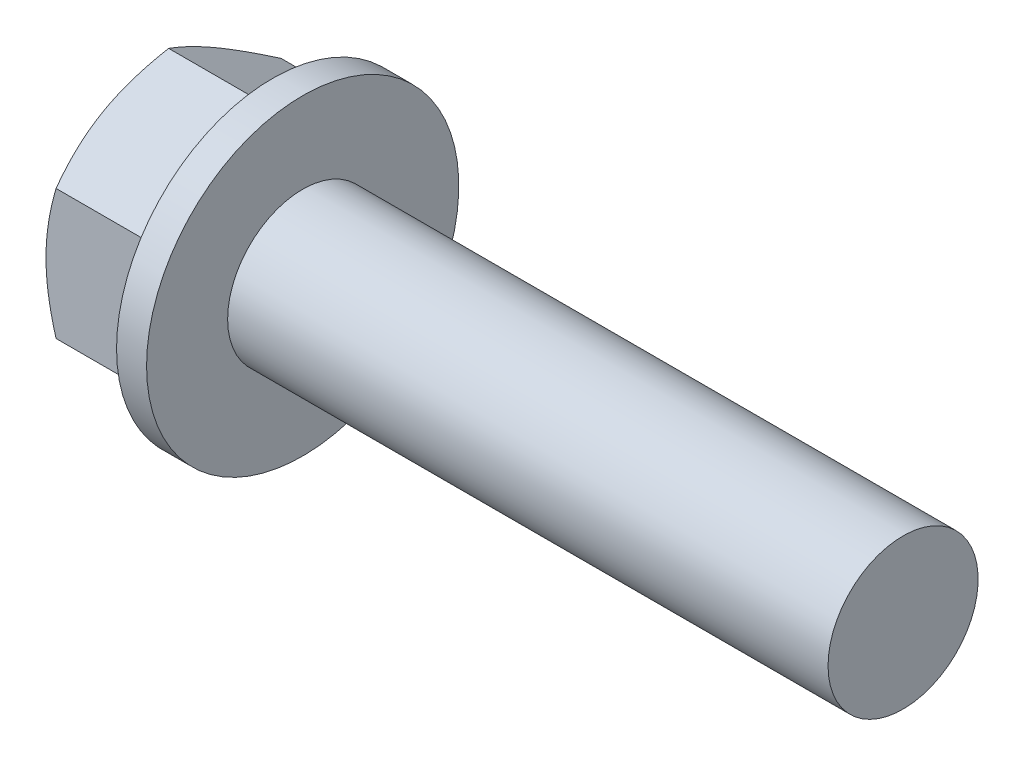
ISO-10303-21;
HEADER;
FILE_DESCRIPTION(('STEP AP214'),'2;1');
FILE_NAME('part.step','',(''),(''),'','','');
FILE_SCHEMA(('AUTOMOTIVE_DESIGN { 1 0 10303 214 1 1 1 1 }'));
ENDSEC;
DATA;
#1=APPLICATION_CONTEXT('core data for automotive mechanical design processes');
#2=APPLICATION_PROTOCOL_DEFINITION('international standard','automotive_design',2000,#1);
#3=PRODUCT_CONTEXT('',#1,'mechanical');
#4=PRODUCT('Part','Part','',(#3));
#5=PRODUCT_RELATED_PRODUCT_CATEGORY('part','',(#4));
#6=PRODUCT_DEFINITION_FORMATION('','',#4);
#7=PRODUCT_DEFINITION_CONTEXT('part definition',#1,'design');
#8=PRODUCT_DEFINITION('design','',#6,#7);
#9=PRODUCT_DEFINITION_SHAPE('','',#8);
#10=(LENGTH_UNIT() NAMED_UNIT(*) SI_UNIT(.MILLI.,.METRE.));
#11=(NAMED_UNIT(*) PLANE_ANGLE_UNIT() SI_UNIT($,.RADIAN.));
#12=(NAMED_UNIT(*) SI_UNIT($,.STERADIAN.) SOLID_ANGLE_UNIT());
#13=UNCERTAINTY_MEASURE_WITH_UNIT(LENGTH_MEASURE(1.E-05),#10,'distance_accuracy_value','');
#14=(GEOMETRIC_REPRESENTATION_CONTEXT(3) GLOBAL_UNCERTAINTY_ASSIGNED_CONTEXT((#13)) GLOBAL_UNIT_ASSIGNED_CONTEXT((#10,
#11,#12)) REPRESENTATION_CONTEXT('',''));
#15=CARTESIAN_POINT('',(0.,0.,0.));
#16=DIRECTION('',(0.,0.,1.));
#17=DIRECTION('',(1.,0.,0.));
#18=AXIS2_PLACEMENT_3D('',#15,#16,#17);
#19=CARTESIAN_POINT('',(0.,0.,0.));
#20=DIRECTION('',(-1.,0.,0.));
#21=DIRECTION('',(0.,0.,1.));
#22=AXIS2_PLACEMENT_3D('',#19,#20,#21);
#23=PLANE('',#22);
#24=CARTESIAN_POINT('',(0.,0.,0.));
#25=DIRECTION('',(-1.,0.,0.));
#26=DIRECTION('',(0.,0.,1.));
#27=AXIS2_PLACEMENT_3D('',#24,#25,#26);
#28=CIRCLE('',#27,4.7625);
#29=CARTESIAN_POINT('',(0.,0.,4.76250000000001));
#30=VERTEX_POINT('',#29);
#31=CARTESIAN_POINT('',(0.,4.12444599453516,2.38125001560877));
#32=VERTEX_POINT('',#31);
#33=EDGE_CURVE('E169',#30,#32,#28,.T.);
#34=ORIENTED_EDGE('',*,*,#33,.T.);
#35=CARTESIAN_POINT('',(0.,4.12444599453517,-2.38125001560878));
#36=VERTEX_POINT('',#35);
#37=EDGE_CURVE('E173',#32,#36,#28,.T.);
#38=ORIENTED_EDGE('',*,*,#37,.T.);
#39=CARTESIAN_POINT('',(0.,0.,-4.76249999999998));
#40=VERTEX_POINT('',#39);
#41=EDGE_CURVE('E422',#36,#40,#28,.T.);
#42=ORIENTED_EDGE('',*,*,#41,.T.);
#43=CARTESIAN_POINT('',(0.,-4.12444599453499,-2.38125001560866));
#44=VERTEX_POINT('',#43);
#45=EDGE_CURVE('E421',#40,#44,#28,.T.);
#46=ORIENTED_EDGE('',*,*,#45,.T.);
#47=CARTESIAN_POINT('',(0.,-4.12444599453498,2.38125001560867));
#48=VERTEX_POINT('',#47);
#49=EDGE_CURVE('E419',#44,#48,#28,.T.);
#50=ORIENTED_EDGE('',*,*,#49,.T.);
#51=EDGE_CURVE('E168',#48,#30,#28,.T.);
#52=ORIENTED_EDGE('',*,*,#51,.T.);
#53=EDGE_LOOP('',(#34,#38,#42,#46,#50,#52));
#54=FACE_BOUND('',#53,.T.);
#55=CARTESIAN_POINT('',(0.,0.,0.));
#56=DIRECTION('',(1.,0.,0.));
#57=DIRECTION('',(0.,0.,-1.));
#58=AXIS2_PLACEMENT_3D('',#55,#56,#57);
#59=CIRCLE('',#58,4.1671875);
#60=CARTESIAN_POINT('',(0.,0.,4.1671875));
#61=VERTEX_POINT('',#60);
#62=EDGE_CURVE('E136',#61,#61,#59,.T.);
#63=ORIENTED_EDGE('',*,*,#62,.T.);
#64=EDGE_LOOP('',(#63));
#65=FACE_BOUND('',#64,.T.);
#66=ADVANCED_FACE('F36',(#54,#65),#23,.T.);
#67=CARTESIAN_POINT('',(-25.4,0.,0.));
#68=DIRECTION('',(-1.,0.,0.));
#69=DIRECTION('',(0.,0.,1.));
#70=AXIS2_PLACEMENT_3D('',#67,#68,#69);
#71=CYLINDRICAL_SURFACE('',#70,3.175);
#72=CARTESIAN_POINT('',(31.496,0.,0.));
#73=DIRECTION('',(-1.,0.,0.));
#74=DIRECTION('',(0.,0.,1.));
#75=AXIS2_PLACEMENT_3D('',#72,#73,#74);
#76=CIRCLE('',#75,3.175);
#77=CARTESIAN_POINT('',(31.496,0.,3.17500000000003));
#78=VERTEX_POINT('',#77);
#79=EDGE_CURVE('E172',#78,#78,#76,.T.);
#80=CARTESIAN_POINT('',(6.09599999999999,0.,0.));
#81=DIRECTION('',(-1.,0.,0.));
#82=DIRECTION('',(0.,0.,1.));
#83=AXIS2_PLACEMENT_3D('',#80,#81,#82);
#84=CIRCLE('',#83,3.175);
#85=CARTESIAN_POINT('',(6.09599999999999,0.,3.17500000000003));
#86=VERTEX_POINT('',#85);
#87=EDGE_CURVE('E149',#86,#86,#84,.T.);
#88=CARTESIAN_POINT('',(31.496,0.,3.17500000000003));
#89=CARTESIAN_POINT('',(31.2314166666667,0.,3.17500000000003));
#90=CARTESIAN_POINT('',(30.9668333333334,0.,3.17500000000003));
#91=CARTESIAN_POINT('',(30.4376666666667,0.,3.17500000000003));
#92=CARTESIAN_POINT('',(30.1730833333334,0.,3.17500000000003));
#93=CARTESIAN_POINT('',(29.6439166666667,0.,3.17500000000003));
#94=CARTESIAN_POINT('',(29.3793333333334,0.,3.17500000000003));
#95=CARTESIAN_POINT('',(28.8501666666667,0.,3.17500000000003));
#96=CARTESIAN_POINT('',(28.5855833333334,0.,3.17500000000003));
#97=CARTESIAN_POINT('',(28.0564166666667,0.,3.17500000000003));
#98=CARTESIAN_POINT('',(27.7918333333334,0.,3.17500000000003));
#99=CARTESIAN_POINT('',(27.2626666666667,0.,3.17500000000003));
#100=CARTESIAN_POINT('',(26.9980833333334,0.,3.17500000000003));
#101=CARTESIAN_POINT('',(26.4689166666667,0.,3.17500000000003));
#102=CARTESIAN_POINT('',(26.2043333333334,0.,3.17500000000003));
#103=CARTESIAN_POINT('',(25.6751666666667,0.,3.17500000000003));
#104=CARTESIAN_POINT('',(25.4105833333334,0.,3.17500000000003));
#105=CARTESIAN_POINT('',(24.8814166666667,0.,3.17500000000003));
#106=CARTESIAN_POINT('',(24.6168333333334,0.,3.17500000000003));
#107=CARTESIAN_POINT('',(24.0876666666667,0.,3.17500000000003));
#108=CARTESIAN_POINT('',(23.8230833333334,0.,3.17500000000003));
#109=CARTESIAN_POINT('',(23.2939166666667,0.,3.17500000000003));
#110=CARTESIAN_POINT('',(23.0293333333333,0.,3.17500000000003));
#111=CARTESIAN_POINT('',(22.5001666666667,0.,3.17500000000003));
#112=CARTESIAN_POINT('',(22.2355833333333,0.,3.17500000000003));
#113=CARTESIAN_POINT('',(21.7064166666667,0.,3.17500000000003));
#114=CARTESIAN_POINT('',(21.4418333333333,0.,3.17500000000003));
#115=CARTESIAN_POINT('',(20.9126666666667,0.,3.17500000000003));
#116=CARTESIAN_POINT('',(20.6480833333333,0.,3.17500000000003));
#117=CARTESIAN_POINT('',(20.1189166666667,0.,3.17500000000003));
#118=CARTESIAN_POINT('',(19.8543333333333,0.,3.17500000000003));
#119=CARTESIAN_POINT('',(19.3251666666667,0.,3.17500000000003));
#120=CARTESIAN_POINT('',(19.0605833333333,0.,3.17500000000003));
#121=CARTESIAN_POINT('',(18.5314166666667,0.,3.17500000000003));
#122=CARTESIAN_POINT('',(18.2668333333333,0.,3.17500000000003));
#123=CARTESIAN_POINT('',(17.7376666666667,0.,3.17500000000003));
#124=CARTESIAN_POINT('',(17.4730833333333,0.,3.17500000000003));
#125=CARTESIAN_POINT('',(16.9439166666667,0.,3.17500000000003));
#126=CARTESIAN_POINT('',(16.6793333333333,0.,3.17500000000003));
#127=CARTESIAN_POINT('',(16.1501666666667,0.,3.17500000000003));
#128=CARTESIAN_POINT('',(15.8855833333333,0.,3.17500000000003));
#129=CARTESIAN_POINT('',(15.3564166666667,0.,3.17500000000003));
#130=CARTESIAN_POINT('',(15.0918333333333,0.,3.17500000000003));
#131=CARTESIAN_POINT('',(14.5626666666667,0.,3.17500000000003));
#132=CARTESIAN_POINT('',(14.2980833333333,0.,3.17500000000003));
#133=CARTESIAN_POINT('',(13.7689166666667,0.,3.17500000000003));
#134=CARTESIAN_POINT('',(13.5043333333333,0.,3.17500000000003));
#135=CARTESIAN_POINT('',(12.9751666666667,0.,3.17500000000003));
#136=CARTESIAN_POINT('',(12.7105833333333,0.,3.17500000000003));
#137=CARTESIAN_POINT('',(12.1814166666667,0.,3.17500000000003));
#138=CARTESIAN_POINT('',(11.9168333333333,0.,3.17500000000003));
#139=CARTESIAN_POINT('',(11.3876666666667,0.,3.17500000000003));
#140=CARTESIAN_POINT('',(11.1230833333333,0.,3.17500000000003));
#141=CARTESIAN_POINT('',(10.5939166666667,0.,3.17500000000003));
#142=CARTESIAN_POINT('',(10.3293333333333,0.,3.17500000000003));
#143=CARTESIAN_POINT('',(9.80016666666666,0.,3.17500000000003));
#144=CARTESIAN_POINT('',(9.53558333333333,0.,3.17500000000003));
#145=CARTESIAN_POINT('',(9.00641666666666,0.,3.17500000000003));
#146=CARTESIAN_POINT('',(8.74183333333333,0.,3.17500000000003));
#147=CARTESIAN_POINT('',(8.21266666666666,0.,3.17500000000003));
#148=CARTESIAN_POINT('',(7.94808333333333,0.,3.17500000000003));
#149=CARTESIAN_POINT('',(7.41891666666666,0.,3.17500000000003));
#150=CARTESIAN_POINT('',(7.15433333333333,0.,3.17500000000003));
#151=CARTESIAN_POINT('',(6.62516666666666,0.,3.17500000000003));
#152=CARTESIAN_POINT('',(6.36058333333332,0.,3.17500000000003));
#153=CARTESIAN_POINT('',(6.09599999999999,0.,3.17500000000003));
#154=B_SPLINE_CURVE_WITH_KNOTS('',3,(#88,#89,#90,#91,#92,#93,#94,#95,#96,#97,#98,#99,#100,#101,
#102,#103,#104,#105,#106,#107,#108,#109,#110,#111,#112,#113,#114,#115,#116,#117,#118,#119,#120,
#121,#122,#123,#124,#125,#126,#127,#128,#129,#130,#131,#132,#133,#134,#135,#136,#137,#138,#139,
#140,#141,#142,#143,#144,#145,#146,#147,#148,#149,#150,#151,#152,#153),.UNSPECIFIED.,.F.,.F.,(4,
2,2,2,2,2,2,2,2,2,2,2,2,2,2,2,2,2,2,2,2,2,2,2,2,2,2,2,2,2,2,2,4),(0.,0.793750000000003,
1.58750000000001,2.38124999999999,3.175,3.96875,4.7625,5.55625000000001,6.35,7.14375,
7.93750000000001,8.73125000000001,9.52500000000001,10.31875,11.1125,11.90625,12.7,13.49375,
14.2875,15.08125,15.875,16.66875,17.4625,18.25625,19.05,19.84375,20.6375,21.43125,22.225,
23.01875,23.8125,24.60625,25.4),.UNSPECIFIED.);
#155=EDGE_CURVE('BSEAM38',#78,#86,#154,.T.);
#156=ORIENTED_EDGE('',*,*,#79,.T.);
#157=ORIENTED_EDGE('',*,*,#87,.F.);
#158=ORIENTED_EDGE('',*,*,#155,.T.);
#159=ORIENTED_EDGE('',*,*,#155,.F.);
#160=EDGE_LOOP('',(#156,#158,#157,#159));
#161=FACE_BOUND('',#160,.T.);
#162=ADVANCED_FACE('F38',(#161),#71,.T.);
#163=CARTESIAN_POINT('',(31.4960000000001,3.175,0.));
#164=DIRECTION('',(1.,0.,0.));
#165=DIRECTION('',(0.,0.,-1.));
#166=AXIS2_PLACEMENT_3D('',#163,#164,#165);
#167=PLANE('',#166);
#168=ORIENTED_EDGE('',*,*,#79,.F.);
#169=EDGE_LOOP('',(#168));
#170=FACE_BOUND('',#169,.T.);
#171=ADVANCED_FACE('F252',(#170),#167,.T.);
#172=CARTESIAN_POINT('',(4.826,5.49942263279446,0.));
#173=DIRECTION('',(-1.,0.,0.));
#174=DIRECTION('',(0.,0.,1.));
#175=AXIS2_PLACEMENT_3D('',#172,#173,#174);
#176=PLANE('',#175);
#177=CARTESIAN_POINT('',(4.82600000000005,0.,0.));
#178=DIRECTION('',(-1.,0.,0.));
#179=DIRECTION('',(0.,0.,1.));
#180=AXIS2_PLACEMENT_3D('',#177,#178,#179);
#181=CIRCLE('',#180,6.604);
#182=CARTESIAN_POINT('',(4.82600000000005,0.,6.60400000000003));
#183=VERTEX_POINT('',#182);
#184=EDGE_CURVE('E165',#183,#183,#181,.T.);
#185=ORIENTED_EDGE('',*,*,#184,.T.);
#186=EDGE_LOOP('',(#185));
#187=FACE_BOUND('',#186,.T.);
#188=DIRECTION('',(0.,1.,0.));
#189=VECTOR('',#188,1.);
#190=CARTESIAN_POINT('',(4.82600000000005,-2.74963066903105,4.76250000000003));
#191=LINE('',#190,#189);
#192=CARTESIAN_POINT('',(4.82600000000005,-2.74963066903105,4.76250000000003));
#193=VERTEX_POINT('',#192);
#194=CARTESIAN_POINT('',(4.826,2.74963066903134,4.76250000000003));
#195=VERTEX_POINT('',#194);
#196=EDGE_CURVE('E124',#193,#195,#191,.T.);
#197=ORIENTED_EDGE('',*,*,#196,.F.);
#198=DIRECTION('',(0.,0.50000000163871,0.866025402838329));
#199=VECTOR('',#198,1.);
#200=CARTESIAN_POINT('',(4.82600000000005,-5.49926133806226,0.));
#201=LINE('',#200,#199);
#202=CARTESIAN_POINT('',(4.82600000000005,-5.49926133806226,0.));
#203=VERTEX_POINT('',#202);
#204=EDGE_CURVE('E118',#203,#193,#201,.T.);
#205=ORIENTED_EDGE('',*,*,#204,.F.);
#206=DIRECTION('',(0.,-0.50000000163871,0.866025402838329));
#207=VECTOR('',#206,1.);
#208=CARTESIAN_POINT('',(4.82600000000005,-2.74963066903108,-4.76249999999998));
#209=LINE('',#208,#207);
#210=CARTESIAN_POINT('',(4.82600000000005,-2.74963066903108,-4.76249999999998));
#211=VERTEX_POINT('',#210);
#212=EDGE_CURVE('E144',#211,#203,#209,.T.);
#213=ORIENTED_EDGE('',*,*,#212,.F.);
#214=DIRECTION('',(0.,-1.,0.));
#215=VECTOR('',#214,1.);
#216=CARTESIAN_POINT('',(4.82600000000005,2.74963066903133,-4.76249999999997));
#217=LINE('',#216,#215);
#218=CARTESIAN_POINT('',(4.82600000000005,2.74963066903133,-4.76249999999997));
#219=VERTEX_POINT('',#218);
#220=EDGE_CURVE('E141',#219,#211,#217,.T.);
#221=ORIENTED_EDGE('',*,*,#220,.F.);
#222=DIRECTION('',(0.,-0.50000000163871,-0.866025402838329));
#223=VECTOR('',#222,1.);
#224=CARTESIAN_POINT('',(4.826,5.4992613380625,0.));
#225=LINE('',#224,#223);
#226=CARTESIAN_POINT('',(4.826,5.4992613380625,0.));
#227=VERTEX_POINT('',#226);
#228=EDGE_CURVE('E128',#227,#219,#225,.T.);
#229=ORIENTED_EDGE('',*,*,#228,.F.);
#230=DIRECTION('',(0.,0.50000000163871,-0.866025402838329));
#231=VECTOR('',#230,1.);
#232=CARTESIAN_POINT('',(4.826,2.74963066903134,4.76250000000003));
#233=LINE('',#232,#231);
#234=EDGE_CURVE('E114',#195,#227,#233,.T.);
#235=ORIENTED_EDGE('',*,*,#234,.F.);
#236=EDGE_LOOP('',(#197,#205,#213,#221,#229,#235));
#237=FACE_BOUND('',#236,.T.);
#238=ADVANCED_FACE('F122',(#187,#237),#176,.T.);
#239=CARTESIAN_POINT('',(-25.4,0.,0.));
#240=DIRECTION('',(-1.,0.,0.));
#241=DIRECTION('',(0.,0.,1.));
#242=AXIS2_PLACEMENT_3D('',#239,#240,#241);
#243=CYLINDRICAL_SURFACE('',#242,6.604);
#244=CARTESIAN_POINT('',(6.09599999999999,0.,0.));
#245=DIRECTION('',(-1.,0.,0.));
#246=DIRECTION('',(0.,0.,1.));
#247=AXIS2_PLACEMENT_3D('',#244,#245,#246);
#248=CIRCLE('',#247,6.604);
#249=CARTESIAN_POINT('',(6.09599999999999,0.,6.60400000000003));
#250=VERTEX_POINT('',#249);
#251=EDGE_CURVE('E162',#250,#250,#248,.T.);
#252=CARTESIAN_POINT('',(6.09599999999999,0.,6.60400000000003));
#253=CARTESIAN_POINT('',(6.08277083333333,0.,6.60400000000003));
#254=CARTESIAN_POINT('',(6.06954166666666,0.,6.60400000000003));
#255=CARTESIAN_POINT('',(6.04308333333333,0.,6.60400000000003));
#256=CARTESIAN_POINT('',(6.02985416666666,0.,6.60400000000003));
#257=CARTESIAN_POINT('',(6.00339583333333,0.,6.60400000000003));
#258=CARTESIAN_POINT('',(5.99016666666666,0.,6.60400000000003));
#259=CARTESIAN_POINT('',(5.96370833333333,0.,6.60400000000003));
#260=CARTESIAN_POINT('',(5.95047916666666,0.,6.60400000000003));
#261=CARTESIAN_POINT('',(5.92402083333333,0.,6.60400000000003));
#262=CARTESIAN_POINT('',(5.91079166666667,0.,6.60400000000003));
#263=CARTESIAN_POINT('',(5.88433333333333,0.,6.60400000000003));
#264=CARTESIAN_POINT('',(5.87110416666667,0.,6.60400000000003));
#265=CARTESIAN_POINT('',(5.84464583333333,0.,6.60400000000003));
#266=CARTESIAN_POINT('',(5.83141666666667,0.,6.60400000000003));
#267=CARTESIAN_POINT('',(5.80495833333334,0.,6.60400000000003));
#268=CARTESIAN_POINT('',(5.79172916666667,0.,6.60400000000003));
#269=CARTESIAN_POINT('',(5.76527083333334,0.,6.60400000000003));
#270=CARTESIAN_POINT('',(5.75204166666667,0.,6.60400000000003));
#271=CARTESIAN_POINT('',(5.72558333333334,0.,6.60400000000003));
#272=CARTESIAN_POINT('',(5.71235416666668,0.,6.60400000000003));
#273=CARTESIAN_POINT('',(5.68589583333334,0.,6.60400000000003));
#274=CARTESIAN_POINT('',(5.67266666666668,0.,6.60400000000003));
#275=CARTESIAN_POINT('',(5.64620833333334,0.,6.60400000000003));
#276=CARTESIAN_POINT('',(5.63297916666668,0.,6.60400000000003));
#277=CARTESIAN_POINT('',(5.60652083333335,0.,6.60400000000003));
#278=CARTESIAN_POINT('',(5.59329166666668,0.,6.60400000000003));
#279=CARTESIAN_POINT('',(5.56683333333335,0.,6.60400000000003));
#280=CARTESIAN_POINT('',(5.55360416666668,0.,6.60400000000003));
#281=CARTESIAN_POINT('',(5.52714583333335,0.,6.60400000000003));
#282=CARTESIAN_POINT('',(5.51391666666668,0.,6.60400000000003));
#283=CARTESIAN_POINT('',(5.48745833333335,0.,6.60400000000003));
#284=CARTESIAN_POINT('',(5.47422916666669,0.,6.60400000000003));
#285=CARTESIAN_POINT('',(5.44777083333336,0.,6.60400000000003));
#286=CARTESIAN_POINT('',(5.43454166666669,0.,6.60400000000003));
#287=CARTESIAN_POINT('',(5.40808333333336,0.,6.60400000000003));
#288=CARTESIAN_POINT('',(5.39485416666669,0.,6.60400000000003));
#289=CARTESIAN_POINT('',(5.36839583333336,0.,6.60400000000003));
#290=CARTESIAN_POINT('',(5.35516666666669,0.,6.60400000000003));
#291=CARTESIAN_POINT('',(5.32870833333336,0.,6.60400000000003));
#292=CARTESIAN_POINT('',(5.31547916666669,0.,6.60400000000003));
#293=CARTESIAN_POINT('',(5.28902083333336,0.,6.60400000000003));
#294=CARTESIAN_POINT('',(5.2757916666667,0.,6.60400000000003));
#295=CARTESIAN_POINT('',(5.24933333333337,0.,6.60400000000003));
#296=CARTESIAN_POINT('',(5.2361041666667,0.,6.60400000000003));
#297=CARTESIAN_POINT('',(5.20964583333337,0.,6.60400000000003));
#298=CARTESIAN_POINT('',(5.1964166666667,0.,6.60400000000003));
#299=CARTESIAN_POINT('',(5.16995833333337,0.,6.60400000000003));
#300=CARTESIAN_POINT('',(5.1567291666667,0.,6.60400000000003));
#301=CARTESIAN_POINT('',(5.13027083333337,0.,6.60400000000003));
#302=CARTESIAN_POINT('',(5.11704166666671,0.,6.60400000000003));
#303=CARTESIAN_POINT('',(5.09058333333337,0.,6.60400000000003));
#304=CARTESIAN_POINT('',(5.07735416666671,0.,6.60400000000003));
#305=CARTESIAN_POINT('',(5.05089583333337,0.,6.60400000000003));
#306=CARTESIAN_POINT('',(5.03766666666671,0.,6.60400000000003));
#307=CARTESIAN_POINT('',(5.01120833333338,0.,6.60400000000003));
#308=CARTESIAN_POINT('',(4.99797916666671,0.,6.60400000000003));
#309=CARTESIAN_POINT('',(4.97152083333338,0.,6.60400000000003));
#310=CARTESIAN_POINT('',(4.95829166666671,0.,6.60400000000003));
#311=CARTESIAN_POINT('',(4.93183333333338,0.,6.60400000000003));
#312=CARTESIAN_POINT('',(4.91860416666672,0.,6.60400000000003));
#313=CARTESIAN_POINT('',(4.89214583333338,0.,6.60400000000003));
#314=CARTESIAN_POINT('',(4.87891666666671,0.,6.60400000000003));
#315=CARTESIAN_POINT('',(4.85245833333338,0.,6.60400000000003));
#316=CARTESIAN_POINT('',(4.83922916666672,0.,6.60400000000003));
#317=CARTESIAN_POINT('',(4.82600000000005,0.,6.60400000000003));
#318=B_SPLINE_CURVE_WITH_KNOTS('',3,(#252,#253,#254,#255,#256,#257,#258,#259,#260,#261,#262,
#263,#264,#265,#266,#267,#268,#269,#270,#271,#272,#273,#274,#275,#276,#277,#278,#279,#280,#281,
#282,#283,#284,#285,#286,#287,#288,#289,#290,#291,#292,#293,#294,#295,#296,#297,#298,#299,#300,
#301,#302,#303,#304,#305,#306,#307,#308,#309,#310,#311,#312,#313,#314,#315,#316,#317),
.UNSPECIFIED.,.F.,.F.,(4,2,2,2,2,2,2,2,2,2,2,2,2,2,2,2,2,2,2,2,2,2,2,2,2,2,2,2,2,2,2,2,4),(0.,
0.0396874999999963,0.0793749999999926,0.119062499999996,0.158749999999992,0.198437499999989,
0.238124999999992,0.277812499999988,0.317499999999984,0.357187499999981,0.396874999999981,
0.43656249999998,0.476249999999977,0.515937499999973,0.555624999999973,0.595312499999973,
0.634999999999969,0.674687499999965,0.714374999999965,0.754062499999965,0.793749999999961,
0.833437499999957,0.873124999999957,0.912812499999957,0.952499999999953,0.99218749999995,
1.03187499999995,1.07156249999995,1.11124999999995,1.15093749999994,1.19062499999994,
1.23031249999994,1.26999999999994),.UNSPECIFIED.);
#319=EDGE_CURVE('BSEAM260',#250,#183,#318,.T.);
#320=ORIENTED_EDGE('',*,*,#251,.T.);
#321=ORIENTED_EDGE('',*,*,#184,.F.);
#322=ORIENTED_EDGE('',*,*,#319,.T.);
#323=ORIENTED_EDGE('',*,*,#319,.F.);
#324=EDGE_LOOP('',(#320,#322,#321,#323));
#325=FACE_BOUND('',#324,.T.);
#326=ADVANCED_FACE('F260',(#325),#243,.T.);
#327=CARTESIAN_POINT('',(6.09599999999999,3.175,0.));
#328=DIRECTION('',(-1.,0.,0.));
#329=DIRECTION('',(0.,0.,1.));
#330=AXIS2_PLACEMENT_3D('',#327,#328,#329);
#331=PLANE('',#330);
#332=ORIENTED_EDGE('',*,*,#251,.F.);
#333=EDGE_LOOP('',(#332));
#334=FACE_BOUND('',#333,.T.);
#335=ORIENTED_EDGE('',*,*,#87,.T.);
#336=EDGE_LOOP('',(#335));
#337=FACE_BOUND('',#336,.T.);
#338=ADVANCED_FACE('F204',(#334,#337),#331,.F.);
#339=CARTESIAN_POINT('',(4.82600000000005,-2.74963066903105,4.76250000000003));
#340=DIRECTION('',(0.,0.,1.));
#341=DIRECTION('',(0.,-1.,0.));
#342=AXIS2_PLACEMENT_3D('',#339,#340,#341);
#343=PLANE('',#342);
#344=DIRECTION('',(-1.,0.,0.));
#345=VECTOR('',#344,1.);
#346=CARTESIAN_POINT('',(4.82600000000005,-2.74963066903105,4.76250000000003));
#347=LINE('',#346,#345);
#348=CARTESIAN_POINT('',(0.425369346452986,-2.74963066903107,4.76249999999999));
#349=VERTEX_POINT('',#348);
#350=EDGE_CURVE('E132',#193,#349,#347,.T.);
#351=ORIENTED_EDGE('',*,*,#350,.F.);
#352=ORIENTED_EDGE('',*,*,#196,.T.);
#353=DIRECTION('',(-1.,0.,0.));
#354=VECTOR('',#353,1.);
#355=CARTESIAN_POINT('',(4.826,2.74963066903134,4.76250000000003));
#356=LINE('',#355,#354);
#357=CARTESIAN_POINT('',(0.425369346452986,2.74963066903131,4.76250000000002));
#358=VERTEX_POINT('',#357);
#359=EDGE_CURVE('E111',#195,#358,#356,.T.);
#360=ORIENTED_EDGE('',*,*,#359,.T.);
#361=CARTESIAN_POINT('',(2.27898968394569,-7.29243864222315,4.76250000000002));
#362=CARTESIAN_POINT('',(2.1779405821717,-7.08333786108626,4.76250000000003));
#363=CARTESIAN_POINT('',(2.07789598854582,-6.87374269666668,4.76250000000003));
#364=CARTESIAN_POINT('',(1.88038982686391,-6.45329629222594,4.76250000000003));
#365=CARTESIAN_POINT('',(1.782928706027,-6.24244484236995,4.76250000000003));
#366=CARTESIAN_POINT('',(1.59065007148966,-5.81807956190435,4.76250000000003));
#367=CARTESIAN_POINT('',(1.49585087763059,-5.60455740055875,4.76250000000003));
#368=CARTESIAN_POINT('',(1.31032432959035,-5.17575810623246,4.76250000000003));
#369=CARTESIAN_POINT('',(1.21959676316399,-4.96048106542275,4.76250000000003));
#370=CARTESIAN_POINT('',(1.04221901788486,-4.52515712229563,4.76250000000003));
#371=CARTESIAN_POINT('',(0.955632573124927,-4.30508410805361,4.76250000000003));
#372=CARTESIAN_POINT('',(0.789241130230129,-3.86234213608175,4.76250000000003));
#373=CARTESIAN_POINT('',(0.709436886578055,-3.63967289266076,4.76250000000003));
#374=CARTESIAN_POINT('',(0.558753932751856,-3.1918423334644,4.76250000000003));
#375=CARTESIAN_POINT('',(0.48785624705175,-2.96668746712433,4.76250000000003));
#376=CARTESIAN_POINT('',(0.357289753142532,-2.51317453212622,4.76250000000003));
#377=CARTESIAN_POINT('',(0.297617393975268,-2.28481750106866,4.76250000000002));
#378=CARTESIAN_POINT('',(0.192395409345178,-1.82475526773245,4.76250000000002));
#379=CARTESIAN_POINT('',(0.146849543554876,-1.59304919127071,4.76250000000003));
#380=CARTESIAN_POINT('',(0.0729585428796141,-1.126810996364,4.76250000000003));
#381=CARTESIAN_POINT('',(0.0446134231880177,-0.892278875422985,4.76250000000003));
#382=CARTESIAN_POINT('',(0.0168133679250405,-0.540107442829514,4.76250000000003));
#383=CARTESIAN_POINT('',(0.00999820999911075,-0.423019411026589,4.76250000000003));
#384=CARTESIAN_POINT('',(0.00132937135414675,-0.18865445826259,4.76250000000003));
#385=CARTESIAN_POINT('',(-0.000524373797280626,-0.0713775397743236,4.76250000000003));
#386=CARTESIAN_POINT('',(0.000779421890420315,0.163114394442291,4.76250000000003));
#387=CARTESIAN_POINT('',(0.00393554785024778,0.280329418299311,4.76250000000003));
#388=CARTESIAN_POINT('',(0.0151790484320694,0.51452469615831,4.76250000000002));
#389=CARTESIAN_POINT('',(0.0232666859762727,0.631504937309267,4.76250000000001));
#390=CARTESIAN_POINT('',(0.0486779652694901,0.915041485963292,4.7625));
#391=CARTESIAN_POINT('',(0.068473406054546,1.08138054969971,4.76250000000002));
#392=CARTESIAN_POINT('',(0.116932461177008,1.41275214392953,4.76250000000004));
#393=CARTESIAN_POINT('',(0.145597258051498,1.57778449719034,4.76250000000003));
#394=CARTESIAN_POINT('',(0.243380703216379,2.0708285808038,4.76250000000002));
#395=CARTESIAN_POINT('',(0.324262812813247,2.39653421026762,4.76250000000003));
#396=CARTESIAN_POINT('',(0.463764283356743,2.88389972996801,4.76250000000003));
#397=CARTESIAN_POINT('',(0.514005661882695,3.04810170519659,4.76250000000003));
#398=CARTESIAN_POINT('',(0.619459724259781,3.37479214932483,4.76250000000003));
#399=CARTESIAN_POINT('',(0.674668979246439,3.53728171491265,4.76250000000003));
#400=CARTESIAN_POINT('',(0.788910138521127,3.85986745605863,4.76250000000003));
#401=CARTESIAN_POINT('',(0.847918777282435,4.01997195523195,4.76250000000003));
#402=CARTESIAN_POINT('',(0.969399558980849,4.33893875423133,4.76250000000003));
#403=CARTESIAN_POINT('',(1.0318731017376,4.49780052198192,4.76250000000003));
#404=CARTESIAN_POINT('',(1.0957371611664,4.6560879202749,4.76250000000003));
#405=B_SPLINE_CURVE_WITH_KNOTS('',3,(#361,#362,#363,#364,#365,#366,#367,#368,#369,#370,#371,
#372,#373,#374,#375,#376,#377,#378,#379,#380,#381,#382,#383,#384,#385,#386,#387,#388,#389,#390,
#391,#392,#393,#394,#395,#396,#397,#398,#399,#400,#401,#402,#403,#404),.UNSPECIFIED.,.F.,.F.,(4,
2,2,2,2,2,2,2,2,2,2,2,2,2,2,2,2,2,2,2,2,4),(0.,0.69672057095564,1.39356097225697,2.094389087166,
2.7951806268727,3.50457590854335,4.21405000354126,4.92198595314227,5.62969758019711,
6.33759739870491,7.04549784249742,7.39726713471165,7.74903185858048,8.10069725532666,
8.45238140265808,8.95463428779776,9.45695416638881,10.4623537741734,10.9774624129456,
11.4922182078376,12.0040766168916,12.51614334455),.UNSPECIFIED.);
#406=EDGE_CURVE('E64',#30,#358,#405,.T.);
#407=ORIENTED_EDGE('',*,*,#406,.F.);
#408=EDGE_CURVE('E210',#349,#30,#405,.T.);
#409=ORIENTED_EDGE('',*,*,#408,.F.);
#410=EDGE_LOOP('',(#351,#352,#360,#407,#409));
#411=FACE_BOUND('',#410,.T.);
#412=ADVANCED_FACE('F130',(#411),#343,.T.);
#413=CARTESIAN_POINT('',(4.82600000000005,-5.49926133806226,0.));
#414=DIRECTION('',(0.,-0.866025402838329,0.50000000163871));
#415=DIRECTION('',(0.,-0.50000000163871,-0.866025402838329));
#416=AXIS2_PLACEMENT_3D('',#413,#414,#415);
#417=PLANE('',#416);
#418=DIRECTION('',(-1.,0.,0.));
#419=VECTOR('',#418,1.);
#420=CARTESIAN_POINT('',(4.82600000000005,-5.49926133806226,0.));
#421=LINE('',#420,#419);
#422=CARTESIAN_POINT('',(0.425369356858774,-5.49926133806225,0.));
#423=VERTEX_POINT('',#422);
#424=EDGE_CURVE('E150',#203,#423,#421,.T.);
#425=ORIENTED_EDGE('',*,*,#424,.F.);
#426=ORIENTED_EDGE('',*,*,#204,.T.);
#427=ORIENTED_EDGE('',*,*,#350,.T.);
#428=CARTESIAN_POINT('',(0.425436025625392,-5.4993768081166,-0.000199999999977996));
#429=CARTESIAN_POINT('',(0.355653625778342,-5.3785389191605,0.209097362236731));
#430=CARTESIAN_POINT('',(0.292183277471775,-5.25666750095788,0.42018484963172));
#431=CARTESIAN_POINT('',(0.181395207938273,-5.01081435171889,0.846014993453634));
#432=CARTESIAN_POINT('',(0.134116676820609,-4.88682825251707,1.06076521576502));
#433=CARTESIAN_POINT('',(0.060533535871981,-4.64037373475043,1.48763696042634));
#434=CARTESIAN_POINT('',(0.0337388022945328,-4.51794369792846,1.69969200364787));
#435=CARTESIAN_POINT('',(0.00971113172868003,-4.33386797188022,2.0185205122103));
#436=CARTESIAN_POINT('',(0.00439465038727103,-4.27246740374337,2.1248694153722));
#437=CARTESIAN_POINT('',(-0.00075982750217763,-4.14960952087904,2.33766550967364));
#438=CARTESIAN_POINT('',(-0.000597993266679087,-4.08815220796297,2.44411269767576));
#439=CARTESIAN_POINT('',(0.00738495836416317,-3.91977562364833,2.7357494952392));
#440=CARTESIAN_POINT('',(0.0207924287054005,-3.8129121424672,2.92084247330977));
#441=CARTESIAN_POINT('',(0.0633078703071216,-3.59989442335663,3.28979998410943));
#442=CARTESIAN_POINT('',(0.0924303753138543,-3.49374093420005,3.47366321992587));
#443=CARTESIAN_POINT('',(0.165229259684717,-3.28029402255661,3.84336411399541));
#444=CARTESIAN_POINT('',(0.209214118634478,-3.17302753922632,4.02915511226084));
#445=CARTESIAN_POINT('',(0.309042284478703,-2.96009431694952,4.39796627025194));
#446=CARTESIAN_POINT('',(0.364862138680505,-2.85442485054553,4.58099115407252));
#447=CARTESIAN_POINT('',(0.425436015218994,-2.7495151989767,4.7627));
#448=B_SPLINE_CURVE_WITH_KNOTS('',3,(#428,#429,#430,#431,#432,#433,#434,#435,#436,#437,#438,
#439,#440,#441,#442,#443,#444,#445,#446,#447),.UNSPECIFIED.,.F.,.F.,(4,2,2,2,2,2,2,2,2,4),(0.,
0.754910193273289,1.51163484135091,2.24963135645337,2.61827337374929,2.98690400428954,
3.62867424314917,4.27103903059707,4.9276515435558,5.58297484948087),.UNSPECIFIED.);
#449=EDGE_CURVE('E216',#48,#349,#448,.T.);
#450=ORIENTED_EDGE('',*,*,#449,.F.);
#451=EDGE_CURVE('E427',#423,#48,#448,.T.);
#452=ORIENTED_EDGE('',*,*,#451,.F.);
#453=EDGE_LOOP('',(#425,#426,#427,#450,#452));
#454=FACE_BOUND('',#453,.T.);
#455=ADVANCED_FACE('F203',(#454),#417,.T.);
#456=CARTESIAN_POINT('',(4.82600000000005,-2.74963066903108,-4.76249999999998));
#457=DIRECTION('',(0.,-0.866025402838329,-0.50000000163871));
#458=DIRECTION('',(0.,0.50000000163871,-0.866025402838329));
#459=AXIS2_PLACEMENT_3D('',#456,#457,#458);
#460=PLANE('',#459);
#461=DIRECTION('',(-1.,0.,0.));
#462=VECTOR('',#461,1.);
#463=CARTESIAN_POINT('',(4.82600000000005,-2.74963066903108,-4.76249999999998));
#464=LINE('',#463,#462);
#465=CARTESIAN_POINT('',(0.425369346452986,-2.74963066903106,-4.76250000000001));
#466=VERTEX_POINT('',#465);
#467=EDGE_CURVE('E153',#211,#466,#464,.T.);
#468=ORIENTED_EDGE('',*,*,#467,.F.);
#469=ORIENTED_EDGE('',*,*,#212,.T.);
#470=ORIENTED_EDGE('',*,*,#424,.T.);
#471=CARTESIAN_POINT('',(0.425436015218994,-2.74951519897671,-4.76269999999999));
#472=CARTESIAN_POINT('',(0.355653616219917,-2.87035308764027,-4.55340263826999));
#473=CARTESIAN_POINT('',(0.292183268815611,-2.99222450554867,-4.34231515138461));
#474=CARTESIAN_POINT('',(0.181395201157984,-3.23807765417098,-3.91648500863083));
#475=CARTESIAN_POINT('',(0.134116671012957,-3.36206375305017,-3.70173478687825));
#476=CARTESIAN_POINT('',(0.0605335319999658,-3.60851827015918,-3.27486304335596));
#477=CARTESIAN_POINT('',(0.0337387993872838,-3.7309483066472,-3.06280800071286));
#478=CARTESIAN_POINT('',(0.0097111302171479,-3.91502403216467,-2.74397949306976));
#479=CARTESIAN_POINT('',(0.004394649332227,-3.97642460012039,-2.6376305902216));
#480=CARTESIAN_POINT('',(-0.000759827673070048,-4.09928248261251,-2.42483449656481));
#481=CARTESIAN_POINT('',(-0.000597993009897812,-4.16073979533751,-2.31838730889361));
#482=CARTESIAN_POINT('',(0.00738495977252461,-4.32911637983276,-2.02675051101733));
#483=CARTESIAN_POINT('',(0.0207924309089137,-4.43597986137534,-1.84165753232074));
#484=CARTESIAN_POINT('',(0.063307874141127,-4.64899758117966,-1.4727000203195));
#485=CARTESIAN_POINT('',(0.0924303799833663,-4.7551510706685,-1.28883678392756));
#486=CARTESIAN_POINT('',(0.165229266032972,-4.96859798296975,-0.91913588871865));
#487=CARTESIAN_POINT('',(0.209214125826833,-5.07586446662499,-0.73334488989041));
#488=CARTESIAN_POINT('',(0.309042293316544,-5.28879768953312,-0.364533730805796));
#489=CARTESIAN_POINT('',(0.364862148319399,-5.39446715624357,-0.181508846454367));
#490=CARTESIAN_POINT('',(0.425436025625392,-5.49937680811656,0.000199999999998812));
#491=B_SPLINE_CURVE_WITH_KNOTS('',3,(#471,#472,#473,#474,#475,#476,#477,#478,#479,#480,#481,
#482,#483,#484,#485,#486,#487,#488,#489,#490),.UNSPECIFIED.,.F.,.F.,(4,2,2,2,2,2,2,2,2,4),(0.,
0.754910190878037,1.51163483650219,2.2496313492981,2.61827336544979,2.98690399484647,
3.62867423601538,4.27103902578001,4.92765154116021,5.58297484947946),.UNSPECIFIED.);
#492=EDGE_CURVE('E40',#44,#423,#491,.T.);
#493=ORIENTED_EDGE('',*,*,#492,.F.);
#494=EDGE_CURVE('E11',#466,#44,#491,.T.);
#495=ORIENTED_EDGE('',*,*,#494,.F.);
#496=EDGE_LOOP('',(#468,#469,#470,#493,#495));
#497=FACE_BOUND('',#496,.T.);
#498=ADVANCED_FACE('F226',(#497),#460,.T.);
#499=CARTESIAN_POINT('',(4.82600000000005,2.74963066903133,-4.76249999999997));
#500=DIRECTION('',(0.,0.,-1.));
#501=DIRECTION('',(-1.,0.,0.));
#502=AXIS2_PLACEMENT_3D('',#499,#500,#501);
#503=PLANE('',#502);
#504=DIRECTION('',(-1.,0.,0.));
#505=VECTOR('',#504,1.);
#506=CARTESIAN_POINT('',(4.82600000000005,2.74963066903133,-4.76249999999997));
#507=LINE('',#506,#505);
#508=CARTESIAN_POINT('',(0.425369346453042,2.74963066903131,-4.7625));
#509=VERTEX_POINT('',#508);
#510=EDGE_CURVE('E156',#219,#509,#507,.T.);
#511=ORIENTED_EDGE('',*,*,#510,.F.);
#512=ORIENTED_EDGE('',*,*,#220,.T.);
#513=ORIENTED_EDGE('',*,*,#467,.T.);
#514=CARTESIAN_POINT('',(2.27898968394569,-7.29243864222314,-4.76250000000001));
#515=CARTESIAN_POINT('',(2.17794058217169,-7.08333786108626,-4.76249999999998));
#516=CARTESIAN_POINT('',(2.0778959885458,-6.87374269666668,-4.76249999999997));
#517=CARTESIAN_POINT('',(1.88038982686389,-6.45329629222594,-4.76249999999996));
#518=CARTESIAN_POINT('',(1.78292870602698,-6.24244484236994,-4.76249999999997));
#519=CARTESIAN_POINT('',(1.59065007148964,-5.81807956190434,-4.76249999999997));
#520=CARTESIAN_POINT('',(1.49585087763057,-5.60455740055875,-4.76249999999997));
#521=CARTESIAN_POINT('',(1.31032432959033,-5.17575810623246,-4.76249999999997));
#522=CARTESIAN_POINT('',(1.21959676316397,-4.96048106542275,-4.76249999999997));
#523=CARTESIAN_POINT('',(1.04221901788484,-4.52515712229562,-4.76249999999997));
#524=CARTESIAN_POINT('',(0.955632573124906,-4.30508410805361,-4.76249999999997));
#525=CARTESIAN_POINT('',(0.789241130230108,-3.86234213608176,-4.76249999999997));
#526=CARTESIAN_POINT('',(0.709436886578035,-3.63967289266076,-4.76249999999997));
#527=CARTESIAN_POINT('',(0.558753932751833,-3.19184233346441,-4.76249999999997));
#528=CARTESIAN_POINT('',(0.487856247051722,-2.96668746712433,-4.76249999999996));
#529=CARTESIAN_POINT('',(0.357289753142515,-2.51317453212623,-4.76249999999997));
#530=CARTESIAN_POINT('',(0.297617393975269,-2.28481750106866,-4.76249999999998));
#531=CARTESIAN_POINT('',(0.192395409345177,-1.82475526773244,-4.76249999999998));
#532=CARTESIAN_POINT('',(0.146849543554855,-1.5930491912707,-4.76249999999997));
#533=CARTESIAN_POINT('',(0.0729585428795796,-1.126810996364,-4.76249999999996));
#534=CARTESIAN_POINT('',(0.0446134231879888,-0.892278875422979,-4.76249999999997));
#535=CARTESIAN_POINT('',(0.0168133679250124,-0.540107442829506,-4.76249999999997));
#536=CARTESIAN_POINT('',(0.00999820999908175,-0.42301941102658,-4.76249999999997));
#537=CARTESIAN_POINT('',(0.00132937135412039,-0.18865445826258,-4.76249999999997));
#538=CARTESIAN_POINT('',(-0.00052437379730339,-0.0713775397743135,-4.76249999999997));
#539=CARTESIAN_POINT('',(0.000779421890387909,0.163114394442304,-4.76249999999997));
#540=CARTESIAN_POINT('',(0.00393554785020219,0.280329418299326,-4.76249999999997));
#541=CARTESIAN_POINT('',(0.0151790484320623,0.514524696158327,-4.76249999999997));
#542=CARTESIAN_POINT('',(0.0232666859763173,0.631504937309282,-4.76249999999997));
#543=CARTESIAN_POINT('',(0.0486779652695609,0.91504148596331,-4.76249999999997));
#544=CARTESIAN_POINT('',(0.0684734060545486,1.08138054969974,-4.76249999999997));
#545=CARTESIAN_POINT('',(0.116932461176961,1.41275214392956,-4.76249999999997));
#546=CARTESIAN_POINT('',(0.145597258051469,1.57778449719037,-4.76249999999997));
#547=CARTESIAN_POINT('',(0.24338070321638,2.07082858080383,-4.76249999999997));
#548=CARTESIAN_POINT('',(0.324262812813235,2.39653421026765,-4.76249999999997));
#549=CARTESIAN_POINT('',(0.463764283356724,2.88389972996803,-4.76249999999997));
#550=CARTESIAN_POINT('',(0.514005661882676,3.0481017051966,-4.76249999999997));
#551=CARTESIAN_POINT('',(0.619459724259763,3.37479214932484,-4.76249999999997));
#552=CARTESIAN_POINT('',(0.674668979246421,3.53728171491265,-4.76249999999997));
#553=CARTESIAN_POINT('',(0.788910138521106,3.85986745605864,-4.76249999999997));
#554=CARTESIAN_POINT('',(0.847918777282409,4.01997195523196,-4.76249999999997));
#555=CARTESIAN_POINT('',(0.969399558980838,4.33893875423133,-4.76249999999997));
#556=CARTESIAN_POINT('',(1.03187310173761,4.49780052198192,-4.76249999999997));
#557=CARTESIAN_POINT('',(1.09573716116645,4.65608792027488,-4.76249999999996));
#558=B_SPLINE_CURVE_WITH_KNOTS('',3,(#514,#515,#516,#517,#518,#519,#520,#521,#522,#523,#524,
#525,#526,#527,#528,#529,#530,#531,#532,#533,#534,#535,#536,#537,#538,#539,#540,#541,#542,#543,
#544,#545,#546,#547,#548,#549,#550,#551,#552,#553,#554,#555,#556,#557),.UNSPECIFIED.,.F.,.F.,(4,
2,2,2,2,2,2,2,2,2,2,2,2,2,2,2,2,2,2,2,2,4),(0.,0.696720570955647,1.39356097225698,
2.09438908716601,2.79518062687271,3.50457590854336,4.21405000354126,4.92198595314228,
5.62969758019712,6.33759739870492,7.04549784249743,7.39726713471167,7.7490318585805,
8.10069725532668,8.45238140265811,8.95463428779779,9.45695416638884,10.4623537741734,
10.9774624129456,11.4922182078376,12.0040766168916,12.51614334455),.UNSPECIFIED.);
#559=EDGE_CURVE('E218',#40,#466,#558,.F.);
#560=ORIENTED_EDGE('',*,*,#559,.F.);
#561=EDGE_CURVE('E211',#509,#40,#558,.F.);
#562=ORIENTED_EDGE('',*,*,#561,.F.);
#563=EDGE_LOOP('',(#511,#512,#513,#560,#562));
#564=FACE_BOUND('',#563,.T.);
#565=ADVANCED_FACE('F223',(#564),#503,.T.);
#566=CARTESIAN_POINT('',(4.826,5.4992613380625,0.));
#567=DIRECTION('',(0.,0.866025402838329,-0.50000000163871));
#568=DIRECTION('',(0.,0.50000000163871,0.866025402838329));
#569=AXIS2_PLACEMENT_3D('',#566,#567,#568);
#570=PLANE('',#569);
#571=DIRECTION('',(-1.,0.,0.));
#572=VECTOR('',#571,1.);
#573=CARTESIAN_POINT('',(4.826,5.4992613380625,0.));
#574=LINE('',#573,#572);
#575=CARTESIAN_POINT('',(0.425369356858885,5.49926133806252,0.));
#576=VERTEX_POINT('',#575);
#577=EDGE_CURVE('E56',#227,#576,#574,.T.);
#578=ORIENTED_EDGE('',*,*,#577,.F.);
#579=ORIENTED_EDGE('',*,*,#228,.T.);
#580=ORIENTED_EDGE('',*,*,#510,.T.);
#581=CARTESIAN_POINT('',(0.425436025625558,5.49937680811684,0.000200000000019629));
#582=CARTESIAN_POINT('',(0.355653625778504,5.37853891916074,-0.209097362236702));
#583=CARTESIAN_POINT('',(0.292183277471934,5.25666750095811,-0.420184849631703));
#584=CARTESIAN_POINT('',(0.181395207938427,5.0108143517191,-0.846014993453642));
#585=CARTESIAN_POINT('',(0.13411667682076,4.88682825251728,-1.06076521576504));
#586=CARTESIAN_POINT('',(0.0605335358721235,4.64037373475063,-1.48763696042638));
#587=CARTESIAN_POINT('',(0.0337388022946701,4.51794369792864,-1.69969200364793));
#588=CARTESIAN_POINT('',(0.00971113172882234,4.3338679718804,-2.01852051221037));
#589=CARTESIAN_POINT('',(0.0043946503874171,4.27246740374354,-2.12486941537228));
#590=CARTESIAN_POINT('',(-0.000759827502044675,4.14960952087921,-2.33766550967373));
#591=CARTESIAN_POINT('',(-0.000597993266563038,4.08815220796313,-2.44411269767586));
#592=CARTESIAN_POINT('',(0.00738495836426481,3.91977562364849,-2.73574949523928));
#593=CARTESIAN_POINT('',(0.0207924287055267,3.81291214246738,-2.92084247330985));
#594=CARTESIAN_POINT('',(0.0633078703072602,3.59989442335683,-3.28979998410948));
#595=CARTESIAN_POINT('',(0.0924303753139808,3.49374093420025,-3.47366321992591));
#596=CARTESIAN_POINT('',(0.165229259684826,3.28029402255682,-3.84336411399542));
#597=CARTESIAN_POINT('',(0.209214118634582,3.17302753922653,-4.02915511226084));
#598=CARTESIAN_POINT('',(0.309042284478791,2.96009431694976,-4.39796627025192));
#599=CARTESIAN_POINT('',(0.364862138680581,2.85442485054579,-4.5809911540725));
#600=CARTESIAN_POINT('',(0.42543601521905,2.749515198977,-4.76269999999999));
#601=B_SPLINE_CURVE_WITH_KNOTS('',3,(#581,#582,#583,#584,#585,#586,#587,#588,#589,#590,#591,
#592,#593,#594,#595,#596,#597,#598,#599,#600),.UNSPECIFIED.,.F.,.F.,(4,2,2,2,2,2,2,2,2,4),(0.,
0.754910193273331,1.511634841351,2.2496313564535,2.61827337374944,2.98690400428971,
3.6286742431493,4.27103903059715,4.92765154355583,5.58297484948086),.UNSPECIFIED.);
#602=EDGE_CURVE('E217',#36,#509,#601,.T.);
#603=ORIENTED_EDGE('',*,*,#602,.F.);
#604=EDGE_CURVE('E183',#576,#36,#601,.T.);
#605=ORIENTED_EDGE('',*,*,#604,.F.);
#606=EDGE_LOOP('',(#578,#579,#580,#603,#605));
#607=FACE_BOUND('',#606,.T.);
#608=ADVANCED_FACE('F197',(#607),#570,.T.);
#609=CARTESIAN_POINT('',(4.826,2.74963066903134,4.76250000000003));
#610=DIRECTION('',(0.,0.866025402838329,0.50000000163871));
#611=DIRECTION('',(0.,-0.50000000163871,0.866025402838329));
#612=AXIS2_PLACEMENT_3D('',#609,#610,#611);
#613=PLANE('',#612);
#614=ORIENTED_EDGE('',*,*,#359,.F.);
#615=ORIENTED_EDGE('',*,*,#234,.T.);
#616=ORIENTED_EDGE('',*,*,#577,.T.);
#617=CARTESIAN_POINT('',(0.42543601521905,2.74951519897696,4.76269999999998));
#618=CARTESIAN_POINT('',(0.355653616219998,2.87035308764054,4.55340263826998));
#619=CARTESIAN_POINT('',(0.292183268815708,2.99222450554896,4.34231515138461));
#620=CARTESIAN_POINT('',(0.181395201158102,3.23807765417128,3.91648500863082));
#621=CARTESIAN_POINT('',(0.134116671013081,3.36206375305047,3.70173478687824));
#622=CARTESIAN_POINT('',(0.060533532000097,3.60851827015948,3.27486304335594));
#623=CARTESIAN_POINT('',(0.0337387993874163,3.7309483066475,3.06280800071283));
#624=CARTESIAN_POINT('',(0.00971113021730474,3.91502403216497,2.74397949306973));
#625=CARTESIAN_POINT('',(0.00439464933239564,3.9764246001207,2.63763059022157));
#626=CARTESIAN_POINT('',(-0.000759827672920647,4.09928248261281,2.42483449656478));
#627=CARTESIAN_POINT('',(-0.000597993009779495,4.1607397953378,2.31838730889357));
#628=CARTESIAN_POINT('',(0.00738495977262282,4.32911637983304,2.02675051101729));
#629=CARTESIAN_POINT('',(0.0207924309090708,4.43597986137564,1.84165753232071));
#630=CARTESIAN_POINT('',(0.0633078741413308,4.64899758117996,1.47270002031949));
#631=CARTESIAN_POINT('',(0.0924303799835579,4.75515107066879,1.28883678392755));
#632=CARTESIAN_POINT('',(0.165229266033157,4.96859798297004,0.919135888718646));
#633=CARTESIAN_POINT('',(0.209214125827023,5.07586446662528,0.73334488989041));
#634=CARTESIAN_POINT('',(0.309042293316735,5.28879768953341,0.364533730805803));
#635=CARTESIAN_POINT('',(0.364862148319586,5.39446715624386,0.181508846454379));
#636=CARTESIAN_POINT('',(0.425436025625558,5.49937680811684,-0.000199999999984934));
#637=B_SPLINE_CURVE_WITH_KNOTS('',3,(#617,#618,#619,#620,#621,#622,#623,#624,#625,#626,#627,
#628,#629,#630,#631,#632,#633,#634,#635,#636),.UNSPECIFIED.,.F.,.F.,(4,2,2,2,2,2,2,2,2,4),(0.,
0.75491019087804,1.5116348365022,2.24963134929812,2.61827336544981,2.9869039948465,
3.62867423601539,4.27103902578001,4.9276515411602,5.58297484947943),.UNSPECIFIED.);
#638=EDGE_CURVE('E176',#32,#576,#637,.T.);
#639=ORIENTED_EDGE('',*,*,#638,.F.);
#640=EDGE_CURVE('E116',#358,#32,#637,.T.);
#641=ORIENTED_EDGE('',*,*,#640,.F.);
#642=EDGE_LOOP('',(#614,#615,#616,#639,#641));
#643=FACE_BOUND('',#642,.T.);
#644=ADVANCED_FACE('F113',(#643),#613,.T.);
#645=CARTESIAN_POINT('',(0.,0.,0.));
#646=DIRECTION('',(1.,0.,0.));
#647=DIRECTION('',(0.,0.,-1.));
#648=AXIS2_PLACEMENT_3D('',#645,#646,#647);
#649=CONICAL_SURFACE('',#648,4.7625,1.0471975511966);
#650=ORIENTED_EDGE('',*,*,#51,.F.);
#651=ORIENTED_EDGE('',*,*,#449,.T.);
#652=ORIENTED_EDGE('',*,*,#408,.T.);
#653=EDGE_LOOP('',(#650,#651,#652));
#654=FACE_BOUND('',#653,.T.);
#655=ADVANCED_FACE('F196',(#654),#649,.T.);
#656=ORIENTED_EDGE('',*,*,#49,.F.);
#657=ORIENTED_EDGE('',*,*,#492,.T.);
#658=ORIENTED_EDGE('',*,*,#451,.T.);
#659=EDGE_LOOP('',(#656,#657,#658));
#660=FACE_BOUND('',#659,.T.);
#661=ADVANCED_FACE('F349',(#660),#649,.T.);
#662=ORIENTED_EDGE('',*,*,#559,.T.);
#663=ORIENTED_EDGE('',*,*,#494,.T.);
#664=ORIENTED_EDGE('',*,*,#45,.F.);
#665=EDGE_LOOP('',(#662,#663,#664));
#666=FACE_BOUND('',#665,.T.);
#667=ADVANCED_FACE('F189',(#666),#649,.T.);
#668=ORIENTED_EDGE('',*,*,#602,.T.);
#669=ORIENTED_EDGE('',*,*,#561,.T.);
#670=ORIENTED_EDGE('',*,*,#41,.F.);
#671=EDGE_LOOP('',(#668,#669,#670));
#672=FACE_BOUND('',#671,.T.);
#673=ADVANCED_FACE('F332',(#672),#649,.T.);
#674=ORIENTED_EDGE('',*,*,#33,.F.);
#675=ORIENTED_EDGE('',*,*,#406,.T.);
#676=ORIENTED_EDGE('',*,*,#640,.T.);
#677=EDGE_LOOP('',(#674,#675,#676));
#678=FACE_BOUND('',#677,.T.);
#679=ADVANCED_FACE('F322',(#678),#649,.T.);
#680=ORIENTED_EDGE('',*,*,#638,.T.);
#681=ORIENTED_EDGE('',*,*,#604,.T.);
#682=ORIENTED_EDGE('',*,*,#37,.F.);
#683=EDGE_LOOP('',(#680,#681,#682));
#684=FACE_BOUND('',#683,.T.);
#685=ADVANCED_FACE('F239',(#684),#649,.T.);
#686=CARTESIAN_POINT('',(0.603250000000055,0.,0.));
#687=DIRECTION('',(-1.,0.,0.));
#688=DIRECTION('',(0.,0.,1.));
#689=AXIS2_PLACEMENT_3D('',#686,#687,#688);
#690=CYLINDRICAL_SURFACE('',#689,4.1671875);
#691=CARTESIAN_POINT('',(0.603250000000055,0.,0.));
#692=DIRECTION('',(1.,0.,0.));
#693=DIRECTION('',(0.,0.,-1.));
#694=AXIS2_PLACEMENT_3D('',#691,#692,#693);
#695=CIRCLE('',#694,4.1671875);
#696=CARTESIAN_POINT('',(0.603250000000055,0.,4.1671875));
#697=VERTEX_POINT('',#696);
#698=EDGE_CURVE('E133',#697,#697,#695,.T.);
#699=CARTESIAN_POINT('',(0.603250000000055,0.,4.1671875));
#700=CARTESIAN_POINT('',(0.596966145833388,0.,4.1671875));
#701=CARTESIAN_POINT('',(0.590682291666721,0.,4.1671875));
#702=CARTESIAN_POINT('',(0.578114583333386,0.,4.1671875));
#703=CARTESIAN_POINT('',(0.571830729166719,0.,4.1671875));
#704=CARTESIAN_POINT('',(0.559263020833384,0.,4.1671875));
#705=CARTESIAN_POINT('',(0.552979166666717,0.,4.1671875));
#706=CARTESIAN_POINT('',(0.540411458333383,0.,4.1671875));
#707=CARTESIAN_POINT('',(0.534127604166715,0.,4.1671875));
#708=CARTESIAN_POINT('',(0.521559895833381,0.,4.1671875));
#709=CARTESIAN_POINT('',(0.515276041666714,0.,4.1671875));
#710=CARTESIAN_POINT('',(0.502708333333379,0.,4.1671875));
#711=CARTESIAN_POINT('',(0.496424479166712,0.,4.1671875));
#712=CARTESIAN_POINT('',(0.483856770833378,0.,4.1671875));
#713=CARTESIAN_POINT('',(0.47757291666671,0.,4.1671875));
#714=CARTESIAN_POINT('',(0.465005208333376,0.,4.1671875));
#715=CARTESIAN_POINT('',(0.458721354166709,0.,4.1671875));
#716=CARTESIAN_POINT('',(0.446153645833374,0.,4.1671875));
#717=CARTESIAN_POINT('',(0.439869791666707,0.,4.1671875));
#718=CARTESIAN_POINT('',(0.427302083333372,0.,4.1671875));
#719=CARTESIAN_POINT('',(0.421018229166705,0.,4.1671875));
#720=CARTESIAN_POINT('',(0.408450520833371,0.,4.1671875));
#721=CARTESIAN_POINT('',(0.402166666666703,0.,4.1671875));
#722=CARTESIAN_POINT('',(0.389598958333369,0.,4.1671875));
#723=CARTESIAN_POINT('',(0.383315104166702,0.,4.1671875));
#724=CARTESIAN_POINT('',(0.370747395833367,0.,4.1671875));
#725=CARTESIAN_POINT('',(0.3644635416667,0.,4.1671875));
#726=CARTESIAN_POINT('',(0.351895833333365,0.,4.1671875));
#727=CARTESIAN_POINT('',(0.345611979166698,0.,4.1671875));
#728=CARTESIAN_POINT('',(0.333044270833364,0.,4.1671875));
#729=CARTESIAN_POINT('',(0.326760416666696,0.,4.1671875));
#730=CARTESIAN_POINT('',(0.314192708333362,0.,4.1671875));
#731=CARTESIAN_POINT('',(0.307908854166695,0.,4.1671875));
#732=CARTESIAN_POINT('',(0.29534114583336,0.,4.1671875));
#733=CARTESIAN_POINT('',(0.289057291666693,0.,4.1671875));
#734=CARTESIAN_POINT('',(0.276489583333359,0.,4.1671875));
#735=CARTESIAN_POINT('',(0.270205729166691,0.,4.1671875));
#736=CARTESIAN_POINT('',(0.257638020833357,0.,4.1671875));
#737=CARTESIAN_POINT('',(0.25135416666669,0.,4.1671875));
#738=CARTESIAN_POINT('',(0.238786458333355,0.,4.1671875));
#739=CARTESIAN_POINT('',(0.232502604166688,0.,4.1671875));
#740=CARTESIAN_POINT('',(0.219934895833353,0.,4.1671875));
#741=CARTESIAN_POINT('',(0.213651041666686,0.,4.1671875));
#742=CARTESIAN_POINT('',(0.201083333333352,0.,4.1671875));
#743=CARTESIAN_POINT('',(0.194799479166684,0.,4.1671875));
#744=CARTESIAN_POINT('',(0.18223177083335,0.,4.1671875));
#745=CARTESIAN_POINT('',(0.175947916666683,0.,4.1671875));
#746=CARTESIAN_POINT('',(0.163380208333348,0.,4.1671875));
#747=CARTESIAN_POINT('',(0.157096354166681,0.,4.1671875));
#748=CARTESIAN_POINT('',(0.144528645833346,0.,4.1671875));
#749=CARTESIAN_POINT('',(0.138244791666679,0.,4.1671875));
#750=CARTESIAN_POINT('',(0.125677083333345,0.,4.1671875));
#751=CARTESIAN_POINT('',(0.119393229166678,0.,4.1671875));
#752=CARTESIAN_POINT('',(0.106825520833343,0.,4.1671875));
#753=CARTESIAN_POINT('',(0.100541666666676,0.,4.1671875));
#754=CARTESIAN_POINT('',(0.0879739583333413,0.,4.1671875));
#755=CARTESIAN_POINT('',(0.081690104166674,0.,4.1671875));
#756=CARTESIAN_POINT('',(0.0691223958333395,0.,4.1671875));
#757=CARTESIAN_POINT('',(0.0628385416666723,0.,4.1671875));
#758=CARTESIAN_POINT('',(0.0502708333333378,0.,4.1671875));
#759=CARTESIAN_POINT('',(0.0439869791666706,0.,4.1671875));
#760=CARTESIAN_POINT('',(0.0314192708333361,0.,4.1671875));
#761=CARTESIAN_POINT('',(0.0251354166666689,0.,4.1671875));
#762=CARTESIAN_POINT('',(0.0125677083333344,0.,4.1671875));
#763=CARTESIAN_POINT('',(0.00628385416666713,0.,4.1671875));
#764=CARTESIAN_POINT('',(0.,0.,4.1671875));
#765=B_SPLINE_CURVE_WITH_KNOTS('',3,(#699,#700,#701,#702,#703,#704,#705,#706,#707,#708,#709,
#710,#711,#712,#713,#714,#715,#716,#717,#718,#719,#720,#721,#722,#723,#724,#725,#726,#727,#728,
#729,#730,#731,#732,#733,#734,#735,#736,#737,#738,#739,#740,#741,#742,#743,#744,#745,#746,#747,
#748,#749,#750,#751,#752,#753,#754,#755,#756,#757,#758,#759,#760,#761,#762,#763,#764),
.UNSPECIFIED.,.F.,.F.,(4,2,2,2,2,2,2,2,2,2,2,2,2,2,2,2,2,2,2,2,2,2,2,2,2,2,2,2,2,2,2,2,4),(0.,
0.0188515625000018,0.0377031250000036,0.0565546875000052,0.075406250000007,0.0942578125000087,
0.11310937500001,0.131960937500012,0.150812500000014,0.169664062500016,0.188515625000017,
0.207367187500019,0.226218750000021,0.245070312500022,0.263921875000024,0.282773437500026,
0.301625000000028,0.320476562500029,0.339328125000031,0.358179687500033,0.377031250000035,
0.395882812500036,0.414734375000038,0.43358593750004,0.452437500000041,0.471289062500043,
0.490140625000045,0.508992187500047,0.527843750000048,0.54669531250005,0.565546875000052,
0.584398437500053,0.603250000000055),.UNSPECIFIED.);
#766=EDGE_CURVE('BSEAM235',#697,#61,#765,.T.);
#767=ORIENTED_EDGE('',*,*,#698,.T.);
#768=ORIENTED_EDGE('',*,*,#62,.F.);
#769=ORIENTED_EDGE('',*,*,#766,.T.);
#770=ORIENTED_EDGE('',*,*,#766,.F.);
#771=EDGE_LOOP('',(#767,#769,#768,#770));
#772=FACE_BOUND('',#771,.T.);
#773=ADVANCED_FACE('F235',(#772),#690,.F.);
#774=CARTESIAN_POINT('',(0.603250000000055,0.,0.));
#775=DIRECTION('',(1.,0.,0.));
#776=DIRECTION('',(0.,0.,-1.));
#777=AXIS2_PLACEMENT_3D('',#774,#775,#776);
#778=PLANE('',#777);
#779=ORIENTED_EDGE('',*,*,#698,.F.);
#780=EDGE_LOOP('',(#779));
#781=FACE_BOUND('',#780,.T.);
#782=ADVANCED_FACE('F238',(#781),#778,.F.);
#783=CLOSED_SHELL('',(#66,#162,#171,#238,#326,#338,#412,#455,#498,#565,#608,#644,#655,#661,#667,
#673,#679,#685,#773,#782));
#784=MANIFOLD_SOLID_BREP('B2',#783);
#785=ADVANCED_BREP_SHAPE_REPRESENTATION('',(#18,#784),#14);
#786=SHAPE_DEFINITION_REPRESENTATION(#9,#785);
ENDSEC;
END-ISO-10303-21;
